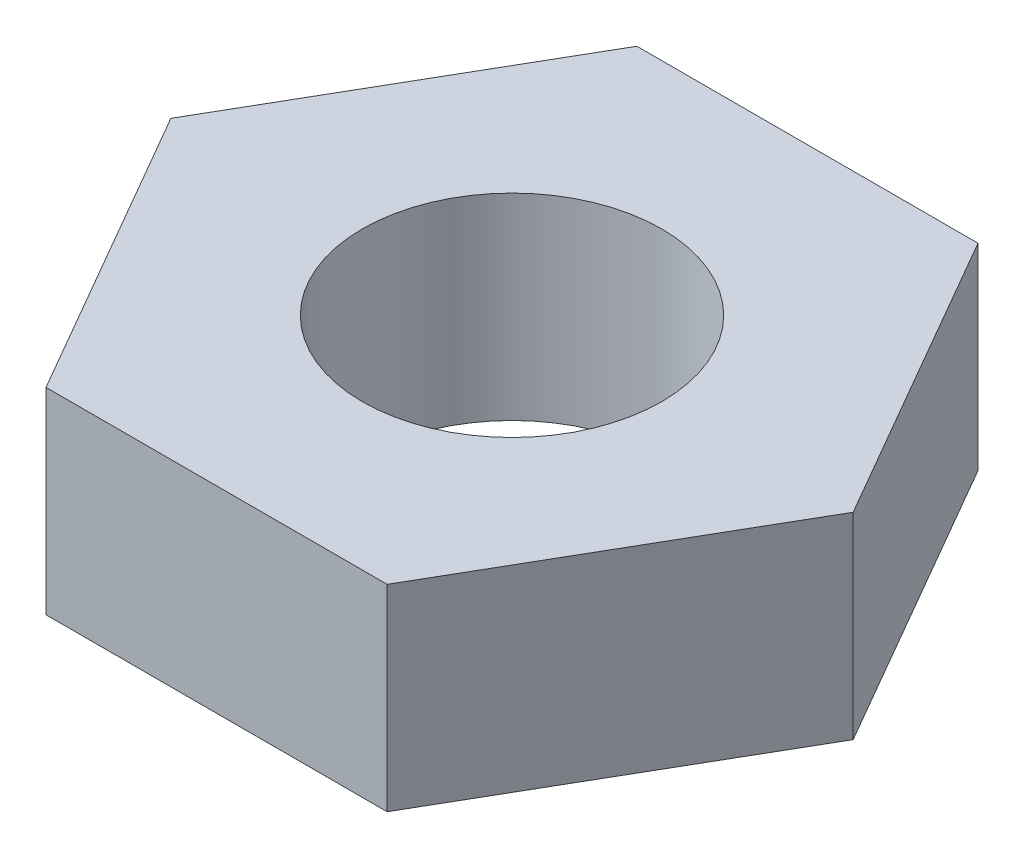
from build123d import *

# Parameters (mm, degrees)
SKETCH1_R           = 2.413
BOSS_EXTRUDE1_DEPTH = 1.5875


with BuildPart() as part:
    # Sketch1 → Boss-Extrude1 (new, symmetric)
    with BuildSketch(Plane(origin=(0, 0, 0), x_dir=(1, 0, 0), z_dir=(0, 1, 0))):
        Polygon((5.499261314, 0), (2.749630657, 4.7625), (-2.749630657, 4.7625), (-5.499261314, 0), (-2.749630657, -4.7625), (2.749630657, -4.7625), align=None)
        with Locations(Location((0, 0, 0), (0, 0, 270))):
            Circle(SKETCH1_R, mode=Mode.SUBTRACT)
    extrude(amount=BOSS_EXTRUDE1_DEPTH, both=True)


solid = part.part
